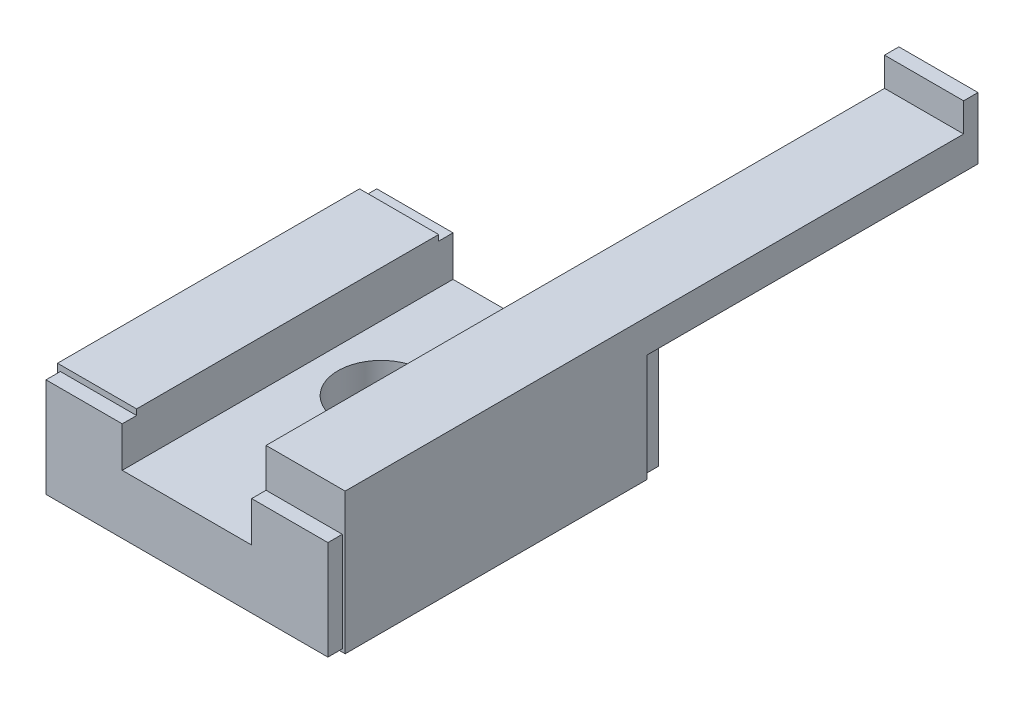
ISO-10303-21;
HEADER;
FILE_DESCRIPTION(('STEP AP214'),'2;1');
FILE_NAME('part.step','',(''),(''),'','','');
FILE_SCHEMA(('AUTOMOTIVE_DESIGN { 1 0 10303 214 1 1 1 1 }'));
ENDSEC;
DATA;
#1=APPLICATION_CONTEXT('core data for automotive mechanical design processes');
#2=APPLICATION_PROTOCOL_DEFINITION('international standard','automotive_design',2000,#1);
#3=PRODUCT_CONTEXT('',#1,'mechanical');
#4=PRODUCT('Part','Part','',(#3));
#5=PRODUCT_RELATED_PRODUCT_CATEGORY('part','',(#4));
#6=PRODUCT_DEFINITION_FORMATION('','',#4);
#7=PRODUCT_DEFINITION_CONTEXT('part definition',#1,'design');
#8=PRODUCT_DEFINITION('design','',#6,#7);
#9=PRODUCT_DEFINITION_SHAPE('','',#8);
#10=(LENGTH_UNIT() NAMED_UNIT(*) SI_UNIT(.MILLI.,.METRE.));
#11=(NAMED_UNIT(*) PLANE_ANGLE_UNIT() SI_UNIT($,.RADIAN.));
#12=(NAMED_UNIT(*) SI_UNIT($,.STERADIAN.) SOLID_ANGLE_UNIT());
#13=UNCERTAINTY_MEASURE_WITH_UNIT(LENGTH_MEASURE(1.E-05),#10,'distance_accuracy_value','');
#14=(GEOMETRIC_REPRESENTATION_CONTEXT(3) GLOBAL_UNCERTAINTY_ASSIGNED_CONTEXT((#13)) GLOBAL_UNIT_ASSIGNED_CONTEXT((#10,
#11,#12)) REPRESENTATION_CONTEXT('',''));
#15=CARTESIAN_POINT('',(0.,0.,0.));
#16=DIRECTION('',(0.,0.,1.));
#17=DIRECTION('',(1.,0.,0.));
#18=AXIS2_PLACEMENT_3D('',#15,#16,#17);
#19=CARTESIAN_POINT('',(4.5,9.8,22.));
#20=DIRECTION('',(0.,1.,0.));
#21=DIRECTION('',(1.,0.,0.));
#22=AXIS2_PLACEMENT_3D('',#19,#20,#21);
#23=PLANE('',#22);
#24=DIRECTION('',(-1.,0.,0.));
#25=VECTOR('',#24,1.);
#26=CARTESIAN_POINT('',(10.,9.8,-21.));
#27=LINE('',#26,#25);
#28=CARTESIAN_POINT('',(4.5,9.8,-21.));
#29=VERTEX_POINT('',#28);
#30=CARTESIAN_POINT('',(10.,9.8,-21.));
#31=VERTEX_POINT('',#30);
#32=EDGE_CURVE('E197',#29,#31,#27,.F.);
#33=ORIENTED_EDGE('',*,*,#32,.F.);
#34=DIRECTION('',(0.,0.,1.));
#35=VECTOR('',#34,1.);
#36=CARTESIAN_POINT('',(4.5,9.8,-21.));
#37=LINE('',#36,#35);
#38=CARTESIAN_POINT('',(4.5,9.8,22.));
#39=VERTEX_POINT('',#38);
#40=EDGE_CURVE('E212',#39,#29,#37,.F.);
#41=ORIENTED_EDGE('',*,*,#40,.F.);
#42=DIRECTION('',(1.,0.,0.));
#43=VECTOR('',#42,1.);
#44=CARTESIAN_POINT('',(4.5,9.8,22.));
#45=LINE('',#44,#43);
#46=CARTESIAN_POINT('',(10.,9.8,22.));
#47=VERTEX_POINT('',#46);
#48=EDGE_CURVE('E221',#47,#39,#45,.F.);
#49=ORIENTED_EDGE('',*,*,#48,.F.);
#50=DIRECTION('',(0.,0.,-1.));
#51=VECTOR('',#50,1.);
#52=CARTESIAN_POINT('',(10.,9.8,22.));
#53=LINE('',#52,#51);
#54=EDGE_CURVE('E214',#47,#31,#53,.T.);
#55=ORIENTED_EDGE('',*,*,#54,.T.);
#56=EDGE_LOOP('',(#33,#41,#49,#55));
#57=FACE_BOUND('',#56,.T.);
#58=ADVANCED_FACE('F16',(#57),#23,.T.);
#59=CARTESIAN_POINT('',(-10.,7.5,22.));
#60=DIRECTION('',(0.,1.,0.));
#61=DIRECTION('',(1.,0.,0.));
#62=AXIS2_PLACEMENT_3D('',#59,#60,#61);
#63=PLANE('',#62);
#64=DIRECTION('',(1.,0.,0.));
#65=VECTOR('',#64,1.);
#66=CARTESIAN_POINT('',(-10.,7.5,22.));
#67=LINE('',#66,#65);
#68=CARTESIAN_POINT('',(-4.5,7.5,22.));
#69=VERTEX_POINT('',#68);
#70=CARTESIAN_POINT('',(-10.,7.5,22.));
#71=VERTEX_POINT('',#70);
#72=EDGE_CURVE('E232',#69,#71,#67,.F.);
#73=ORIENTED_EDGE('',*,*,#72,.F.);
#74=DIRECTION('',(0.,0.,-1.));
#75=VECTOR('',#74,1.);
#76=CARTESIAN_POINT('',(-4.5,7.5,22.));
#77=LINE('',#76,#75);
#78=CARTESIAN_POINT('',(-4.5,7.5,1.));
#79=VERTEX_POINT('',#78);
#80=EDGE_CURVE('E236',#69,#79,#77,.T.);
#81=ORIENTED_EDGE('',*,*,#80,.T.);
#82=DIRECTION('',(-1.,0.,0.));
#83=VECTOR('',#82,1.);
#84=CARTESIAN_POINT('',(-4.5,7.5,1.));
#85=LINE('',#84,#83);
#86=CARTESIAN_POINT('',(-10.,7.5,1.));
#87=VERTEX_POINT('',#86);
#88=EDGE_CURVE('E241',#79,#87,#85,.T.);
#89=ORIENTED_EDGE('',*,*,#88,.T.);
#90=DIRECTION('',(0.,0.,1.));
#91=VECTOR('',#90,1.);
#92=CARTESIAN_POINT('',(-10.,7.5,1.));
#93=LINE('',#92,#91);
#94=EDGE_CURVE('E246',#71,#87,#93,.F.);
#95=ORIENTED_EDGE('',*,*,#94,.F.);
#96=EDGE_LOOP('',(#73,#81,#89,#95));
#97=FACE_BOUND('',#96,.T.);
#98=ADVANCED_FACE('F639',(#97),#63,.T.);
#99=CARTESIAN_POINT('',(-10.,0.,22.));
#100=DIRECTION('',(-1.,0.,0.));
#101=DIRECTION('',(0.,1.,0.));
#102=AXIS2_PLACEMENT_3D('',#99,#100,#101);
#103=PLANE('',#102);
#104=DIRECTION('',(0.,1.,0.));
#105=VECTOR('',#104,1.);
#106=CARTESIAN_POINT('',(-10.,0.,22.));
#107=LINE('',#106,#105);
#108=CARTESIAN_POINT('',(-10.,0.,22.));
#109=VERTEX_POINT('',#108);
#110=EDGE_CURVE('E251',#71,#109,#107,.F.);
#111=ORIENTED_EDGE('',*,*,#110,.F.);
#112=ORIENTED_EDGE('',*,*,#94,.T.);
#113=DIRECTION('',(0.,-1.,0.));
#114=VECTOR('',#113,1.);
#115=CARTESIAN_POINT('',(-10.,7.5,1.));
#116=LINE('',#115,#114);
#117=CARTESIAN_POINT('',(-10.,0.,1.));
#118=VERTEX_POINT('',#117);
#119=EDGE_CURVE('E255',#87,#118,#116,.T.);
#120=ORIENTED_EDGE('',*,*,#119,.T.);
#121=DIRECTION('',(0.,0.,1.));
#122=VECTOR('',#121,1.);
#123=CARTESIAN_POINT('',(-10.,0.,1.));
#124=LINE('',#123,#122);
#125=EDGE_CURVE('E260',#109,#118,#124,.F.);
#126=ORIENTED_EDGE('',*,*,#125,.F.);
#127=EDGE_LOOP('',(#111,#112,#120,#126));
#128=FACE_BOUND('',#127,.T.);
#129=ADVANCED_FACE('F644',(#128),#103,.T.);
#130=CARTESIAN_POINT('',(-10.,0.,1.));
#131=DIRECTION('',(0.,-1.,0.));
#132=DIRECTION('',(1.,0.,0.));
#133=AXIS2_PLACEMENT_3D('',#130,#131,#132);
#134=PLANE('',#133);
#135=DIRECTION('',(-1.,0.,0.));
#136=VECTOR('',#135,1.);
#137=CARTESIAN_POINT('',(-4.,0.,22.));
#138=LINE('',#137,#136);
#139=CARTESIAN_POINT('',(-4.,0.,22.));
#140=VERTEX_POINT('',#139);
#141=EDGE_CURVE('E265',#109,#140,#138,.F.);
#142=ORIENTED_EDGE('',*,*,#141,.F.);
#143=ORIENTED_EDGE('',*,*,#125,.T.);
#144=DIRECTION('',(1.,0.,0.));
#145=VECTOR('',#144,1.);
#146=CARTESIAN_POINT('',(-10.,0.,1.));
#147=LINE('',#146,#145);
#148=CARTESIAN_POINT('',(-4.,0.,1.));
#149=VERTEX_POINT('',#148);
#150=EDGE_CURVE('E269',#118,#149,#147,.T.);
#151=ORIENTED_EDGE('',*,*,#150,.T.);
#152=DIRECTION('',(0.,0.,1.));
#153=VECTOR('',#152,1.);
#154=CARTESIAN_POINT('',(-4.,0.,1.));
#155=LINE('',#154,#153);
#156=EDGE_CURVE('E274',#140,#149,#155,.F.);
#157=ORIENTED_EDGE('',*,*,#156,.F.);
#158=EDGE_LOOP('',(#142,#143,#151,#157));
#159=FACE_BOUND('',#158,.T.);
#160=CARTESIAN_POINT('',(-7.5,0.,5.5));
#161=DIRECTION('',(0.,1.,0.));
#162=DIRECTION('',(0.,0.,-1.));
#163=AXIS2_PLACEMENT_3D('',#160,#161,#162);
#164=CIRCLE('',#163,1.5);
#165=CARTESIAN_POINT('',(-7.5,0.,4.));
#166=VERTEX_POINT('',#165);
#167=EDGE_CURVE('E279',#166,#166,#164,.F.);
#168=ORIENTED_EDGE('',*,*,#167,.F.);
#169=EDGE_LOOP('',(#168));
#170=FACE_BOUND('',#169,.T.);
#171=CARTESIAN_POINT('',(-7.5,0.,17.5));
#172=DIRECTION('',(0.,1.,0.));
#173=DIRECTION('',(0.,0.,-1.));
#174=AXIS2_PLACEMENT_3D('',#171,#172,#173);
#175=CIRCLE('',#174,1.5);
#176=CARTESIAN_POINT('',(-7.5,0.,16.));
#177=VERTEX_POINT('',#176);
#178=EDGE_CURVE('E284',#177,#177,#175,.F.);
#179=ORIENTED_EDGE('',*,*,#178,.F.);
#180=EDGE_LOOP('',(#179));
#181=FACE_BOUND('',#180,.T.);
#182=ADVANCED_FACE('F650',(#159,#170,#181),#134,.T.);
#183=CARTESIAN_POINT('',(-3.8,0.2,1.));
#184=DIRECTION('',(0.707106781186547,-0.707106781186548,0.));
#185=DIRECTION('',(0.,0.,1.));
#186=AXIS2_PLACEMENT_3D('',#183,#184,#185);
#187=PLANE('',#186);
#188=DIRECTION('',(-0.707106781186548,-0.707106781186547,0.));
#189=VECTOR('',#188,1.);
#190=CARTESIAN_POINT('',(-3.8,0.2,22.));
#191=LINE('',#190,#189);
#192=CARTESIAN_POINT('',(-3.8,0.2,22.));
#193=VERTEX_POINT('',#192);
#194=EDGE_CURVE('E287',#140,#193,#191,.F.);
#195=ORIENTED_EDGE('',*,*,#194,.F.);
#196=ORIENTED_EDGE('',*,*,#156,.T.);
#197=DIRECTION('',(0.707106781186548,0.707106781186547,0.));
#198=VECTOR('',#197,1.);
#199=CARTESIAN_POINT('',(-4.,0.,1.));
#200=LINE('',#199,#198);
#201=CARTESIAN_POINT('',(-3.8,0.199999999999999,1.));
#202=VERTEX_POINT('',#201);
#203=EDGE_CURVE('E289',#149,#202,#200,.T.);
#204=ORIENTED_EDGE('',*,*,#203,.T.);
#205=DIRECTION('',(0.,0.,1.));
#206=VECTOR('',#205,1.);
#207=CARTESIAN_POINT('',(-3.8,0.199999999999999,1.));
#208=LINE('',#207,#206);
#209=EDGE_CURVE('E294',#193,#202,#208,.F.);
#210=ORIENTED_EDGE('',*,*,#209,.F.);
#211=EDGE_LOOP('',(#195,#196,#204,#210));
#212=FACE_BOUND('',#211,.T.);
#213=ADVANCED_FACE('F654',(#212),#187,.T.);
#214=CARTESIAN_POINT('',(4.,0.,1.));
#215=DIRECTION('',(-0.707106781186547,-0.707106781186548,0.));
#216=DIRECTION('',(0.,0.,1.));
#217=AXIS2_PLACEMENT_3D('',#214,#215,#216);
#218=PLANE('',#217);
#219=DIRECTION('',(-0.707106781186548,0.707106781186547,0.));
#220=VECTOR('',#219,1.);
#221=CARTESIAN_POINT('',(4.,0.,22.));
#222=LINE('',#221,#220);
#223=CARTESIAN_POINT('',(3.8,0.2,22.));
#224=VERTEX_POINT('',#223);
#225=CARTESIAN_POINT('',(4.,0.,22.));
#226=VERTEX_POINT('',#225);
#227=EDGE_CURVE('E299',#224,#226,#222,.F.);
#228=ORIENTED_EDGE('',*,*,#227,.F.);
#229=DIRECTION('',(0.,0.,-1.));
#230=VECTOR('',#229,1.);
#231=CARTESIAN_POINT('',(3.8,0.2,22.));
#232=LINE('',#231,#230);
#233=CARTESIAN_POINT('',(3.8,0.2,1.));
#234=VERTEX_POINT('',#233);
#235=EDGE_CURVE('E303',#224,#234,#232,.T.);
#236=ORIENTED_EDGE('',*,*,#235,.T.);
#237=DIRECTION('',(0.707106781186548,-0.707106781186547,0.));
#238=VECTOR('',#237,1.);
#239=CARTESIAN_POINT('',(3.8,0.2,1.));
#240=LINE('',#239,#238);
#241=CARTESIAN_POINT('',(4.,0.,1.));
#242=VERTEX_POINT('',#241);
#243=EDGE_CURVE('E308',#234,#242,#240,.T.);
#244=ORIENTED_EDGE('',*,*,#243,.T.);
#245=DIRECTION('',(0.,0.,1.));
#246=VECTOR('',#245,1.);
#247=CARTESIAN_POINT('',(4.,0.,1.));
#248=LINE('',#247,#246);
#249=EDGE_CURVE('E313',#226,#242,#248,.F.);
#250=ORIENTED_EDGE('',*,*,#249,.F.);
#251=EDGE_LOOP('',(#228,#236,#244,#250));
#252=FACE_BOUND('',#251,.T.);
#253=ADVANCED_FACE('F658',(#252),#218,.T.);
#254=CARTESIAN_POINT('',(4.,0.,1.));
#255=DIRECTION('',(0.,-1.,0.));
#256=DIRECTION('',(1.,0.,0.));
#257=AXIS2_PLACEMENT_3D('',#254,#255,#256);
#258=PLANE('',#257);
#259=DIRECTION('',(-1.,0.,0.));
#260=VECTOR('',#259,1.);
#261=CARTESIAN_POINT('',(10.,0.,22.));
#262=LINE('',#261,#260);
#263=CARTESIAN_POINT('',(10.,0.,22.));
#264=VERTEX_POINT('',#263);
#265=EDGE_CURVE('E318',#226,#264,#262,.F.);
#266=ORIENTED_EDGE('',*,*,#265,.F.);
#267=ORIENTED_EDGE('',*,*,#249,.T.);
#268=DIRECTION('',(1.,0.,0.));
#269=VECTOR('',#268,1.);
#270=CARTESIAN_POINT('',(4.,0.,1.));
#271=LINE('',#270,#269);
#272=CARTESIAN_POINT('',(10.,0.,1.));
#273=VERTEX_POINT('',#272);
#274=EDGE_CURVE('E322',#242,#273,#271,.T.);
#275=ORIENTED_EDGE('',*,*,#274,.T.);
#276=DIRECTION('',(0.,0.,1.));
#277=VECTOR('',#276,1.);
#278=CARTESIAN_POINT('',(10.,0.,1.));
#279=LINE('',#278,#277);
#280=EDGE_CURVE('E327',#264,#273,#279,.F.);
#281=ORIENTED_EDGE('',*,*,#280,.F.);
#282=EDGE_LOOP('',(#266,#267,#275,#281));
#283=FACE_BOUND('',#282,.T.);
#284=CARTESIAN_POINT('',(7.5,0.,5.5));
#285=DIRECTION('',(0.,1.,0.));
#286=DIRECTION('',(0.,0.,-1.));
#287=AXIS2_PLACEMENT_3D('',#284,#285,#286);
#288=CIRCLE('',#287,1.5);
#289=CARTESIAN_POINT('',(7.5,0.,4.));
#290=VERTEX_POINT('',#289);
#291=EDGE_CURVE('E332',#290,#290,#288,.F.);
#292=ORIENTED_EDGE('',*,*,#291,.F.);
#293=EDGE_LOOP('',(#292));
#294=FACE_BOUND('',#293,.T.);
#295=CARTESIAN_POINT('',(7.5,0.,17.5));
#296=DIRECTION('',(0.,1.,0.));
#297=DIRECTION('',(0.,0.,-1.));
#298=AXIS2_PLACEMENT_3D('',#295,#296,#297);
#299=CIRCLE('',#298,1.5);
#300=CARTESIAN_POINT('',(7.5,0.,16.));
#301=VERTEX_POINT('',#300);
#302=EDGE_CURVE('E337',#301,#301,#299,.F.);
#303=ORIENTED_EDGE('',*,*,#302,.F.);
#304=EDGE_LOOP('',(#303));
#305=FACE_BOUND('',#304,.T.);
#306=ADVANCED_FACE('F662',(#283,#294,#305),#258,.T.);
#307=CARTESIAN_POINT('',(10.,0.,-22.));
#308=DIRECTION('',(1.,0.,0.));
#309=DIRECTION('',(0.,1.,0.));
#310=AXIS2_PLACEMENT_3D('',#307,#308,#309);
#311=PLANE('',#310);
#312=DIRECTION('',(0.,-1.,0.));
#313=VECTOR('',#312,1.);
#314=CARTESIAN_POINT('',(10.,9.8,22.));
#315=LINE('',#314,#313);
#316=EDGE_CURVE('E340',#264,#47,#315,.F.);
#317=ORIENTED_EDGE('',*,*,#316,.F.);
#318=ORIENTED_EDGE('',*,*,#280,.T.);
#319=DIRECTION('',(0.,1.,0.));
#320=VECTOR('',#319,1.);
#321=CARTESIAN_POINT('',(10.,0.,0.999999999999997));
#322=LINE('',#321,#320);
#323=CARTESIAN_POINT('',(10.,7.5,0.999999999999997));
#324=VERTEX_POINT('',#323);
#325=EDGE_CURVE('E342',#273,#324,#322,.T.);
#326=ORIENTED_EDGE('',*,*,#325,.T.);
#327=DIRECTION('',(0.,0.,-1.));
#328=VECTOR('',#327,1.);
#329=CARTESIAN_POINT('',(10.,7.5,0.999999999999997));
#330=LINE('',#329,#328);
#331=CARTESIAN_POINT('',(10.,7.5,-22.));
#332=VERTEX_POINT('',#331);
#333=EDGE_CURVE('E347',#332,#324,#330,.F.);
#334=ORIENTED_EDGE('',*,*,#333,.F.);
#335=DIRECTION('',(0.,1.,0.));
#336=VECTOR('',#335,1.);
#337=CARTESIAN_POINT('',(10.,7.5,-22.));
#338=LINE('',#337,#336);
#339=CARTESIAN_POINT('',(10.,11.8,-22.));
#340=VERTEX_POINT('',#339);
#341=EDGE_CURVE('E351',#332,#340,#338,.T.);
#342=ORIENTED_EDGE('',*,*,#341,.T.);
#343=DIRECTION('',(0.,0.,1.));
#344=VECTOR('',#343,1.);
#345=CARTESIAN_POINT('',(10.,11.8,-22.));
#346=LINE('',#345,#344);
#347=CARTESIAN_POINT('',(10.,11.8,-21.));
#348=VERTEX_POINT('',#347);
#349=EDGE_CURVE('E356',#348,#340,#346,.F.);
#350=ORIENTED_EDGE('',*,*,#349,.F.);
#351=DIRECTION('',(0.,-1.,0.));
#352=VECTOR('',#351,1.);
#353=CARTESIAN_POINT('',(10.,11.8,-21.));
#354=LINE('',#353,#352);
#355=EDGE_CURVE('E360',#31,#348,#354,.F.);
#356=ORIENTED_EDGE('',*,*,#355,.F.);
#357=ORIENTED_EDGE('',*,*,#54,.F.);
#358=EDGE_LOOP('',(#317,#318,#326,#334,#342,#350,#356,#357));
#359=FACE_BOUND('',#358,.T.);
#360=ADVANCED_FACE('F666',(#359),#311,.T.);
#361=CARTESIAN_POINT('',(4.5,4.3,23.));
#362=DIRECTION('',(-1.,0.,0.));
#363=DIRECTION('',(0.,1.,0.));
#364=AXIS2_PLACEMENT_3D('',#361,#362,#363);
#365=PLANE('',#364);
#366=DIRECTION('',(0.,1.,0.));
#367=VECTOR('',#366,1.);
#368=CARTESIAN_POINT('',(4.5,4.3,23.));
#369=LINE('',#368,#367);
#370=CARTESIAN_POINT('',(4.5,7.1,23.));
#371=VERTEX_POINT('',#370);
#372=CARTESIAN_POINT('',(4.5,4.3,23.));
#373=VERTEX_POINT('',#372);
#374=EDGE_CURVE('E364',#371,#373,#369,.F.);
#375=ORIENTED_EDGE('',*,*,#374,.F.);
#376=DIRECTION('',(0.,0.,-1.));
#377=VECTOR('',#376,1.);
#378=CARTESIAN_POINT('',(4.5,7.1,23.));
#379=LINE('',#378,#377);
#380=CARTESIAN_POINT('',(4.5,7.1,22.));
#381=VERTEX_POINT('',#380);
#382=EDGE_CURVE('E368',#381,#371,#379,.F.);
#383=ORIENTED_EDGE('',*,*,#382,.F.);
#384=DIRECTION('',(0.,1.,0.));
#385=VECTOR('',#384,1.);
#386=CARTESIAN_POINT('',(4.5,7.1,22.));
#387=LINE('',#386,#385);
#388=EDGE_CURVE('E206',#39,#381,#387,.F.);
#389=ORIENTED_EDGE('',*,*,#388,.F.);
#390=ORIENTED_EDGE('',*,*,#40,.T.);
#391=DIRECTION('',(0.,1.,0.));
#392=VECTOR('',#391,1.);
#393=CARTESIAN_POINT('',(4.5,9.8,-21.));
#394=LINE('',#393,#392);
#395=CARTESIAN_POINT('',(4.5,11.8,-21.));
#396=VERTEX_POINT('',#395);
#397=EDGE_CURVE('E194',#396,#29,#394,.F.);
#398=ORIENTED_EDGE('',*,*,#397,.F.);
#399=DIRECTION('',(0.,0.,-1.));
#400=VECTOR('',#399,1.);
#401=CARTESIAN_POINT('',(4.5,11.8,-21.));
#402=LINE('',#401,#400);
#403=CARTESIAN_POINT('',(4.5,11.8,-22.));
#404=VERTEX_POINT('',#403);
#405=EDGE_CURVE('E205',#396,#404,#402,.T.);
#406=ORIENTED_EDGE('',*,*,#405,.T.);
#407=DIRECTION('',(0.,-1.,0.));
#408=VECTOR('',#407,1.);
#409=CARTESIAN_POINT('',(4.5,11.8,-22.));
#410=LINE('',#409,#408);
#411=CARTESIAN_POINT('',(4.5,7.5,-22.));
#412=VERTEX_POINT('',#411);
#413=EDGE_CURVE('E380',#404,#412,#410,.T.);
#414=ORIENTED_EDGE('',*,*,#413,.T.);
#415=DIRECTION('',(0.,0.,1.));
#416=VECTOR('',#415,1.);
#417=CARTESIAN_POINT('',(4.5,7.5,-22.));
#418=LINE('',#417,#416);
#419=CARTESIAN_POINT('',(4.5,7.5,0.));
#420=VERTEX_POINT('',#419);
#421=EDGE_CURVE('E385',#412,#420,#418,.T.);
#422=ORIENTED_EDGE('',*,*,#421,.T.);
#423=DIRECTION('',(0.,-1.,0.));
#424=VECTOR('',#423,1.);
#425=CARTESIAN_POINT('',(4.5,7.5,0.));
#426=LINE('',#425,#424);
#427=CARTESIAN_POINT('',(4.5,4.3,0.));
#428=VERTEX_POINT('',#427);
#429=EDGE_CURVE('E390',#420,#428,#426,.T.);
#430=ORIENTED_EDGE('',*,*,#429,.T.);
#431=DIRECTION('',(0.,0.,1.));
#432=VECTOR('',#431,1.);
#433=CARTESIAN_POINT('',(4.5,4.3,0.));
#434=LINE('',#433,#432);
#435=EDGE_CURVE('E395',#373,#428,#434,.F.);
#436=ORIENTED_EDGE('',*,*,#435,.F.);
#437=EDGE_LOOP('',(#375,#383,#389,#390,#398,#406,#414,#422,#430,#436));
#438=FACE_BOUND('',#437,.T.);
#439=ADVANCED_FACE('F218',(#438),#365,.T.);
#440=CARTESIAN_POINT('',(-4.5,4.3,0.));
#441=DIRECTION('',(1.,0.,0.));
#442=DIRECTION('',(0.,1.,0.));
#443=AXIS2_PLACEMENT_3D('',#440,#441,#442);
#444=PLANE('',#443);
#445=DIRECTION('',(0.,-1.,0.));
#446=VECTOR('',#445,1.);
#447=CARTESIAN_POINT('',(-4.5,7.5,22.));
#448=LINE('',#447,#446);
#449=CARTESIAN_POINT('',(-4.5,7.1,22.));
#450=VERTEX_POINT('',#449);
#451=EDGE_CURVE('E399',#450,#69,#448,.F.);
#452=ORIENTED_EDGE('',*,*,#451,.F.);
#453=DIRECTION('',(0.,0.,1.));
#454=VECTOR('',#453,1.);
#455=CARTESIAN_POINT('',(-4.5,7.1,22.));
#456=LINE('',#455,#454);
#457=CARTESIAN_POINT('',(-4.5,7.1,23.));
#458=VERTEX_POINT('',#457);
#459=EDGE_CURVE('E403',#450,#458,#456,.T.);
#460=ORIENTED_EDGE('',*,*,#459,.T.);
#461=DIRECTION('',(0.,-1.,0.));
#462=VECTOR('',#461,1.);
#463=CARTESIAN_POINT('',(-4.5,7.1,23.));
#464=LINE('',#463,#462);
#465=CARTESIAN_POINT('',(-4.5,4.3,23.));
#466=VERTEX_POINT('',#465);
#467=EDGE_CURVE('E408',#466,#458,#464,.F.);
#468=ORIENTED_EDGE('',*,*,#467,.F.);
#469=DIRECTION('',(0.,0.,-1.));
#470=VECTOR('',#469,1.);
#471=CARTESIAN_POINT('',(-4.5,4.3,23.));
#472=LINE('',#471,#470);
#473=CARTESIAN_POINT('',(-4.5,4.3,0.));
#474=VERTEX_POINT('',#473);
#475=EDGE_CURVE('E413',#466,#474,#472,.T.);
#476=ORIENTED_EDGE('',*,*,#475,.T.);
#477=DIRECTION('',(0.,1.,0.));
#478=VECTOR('',#477,1.);
#479=CARTESIAN_POINT('',(-4.5,4.3,0.));
#480=LINE('',#479,#478);
#481=CARTESIAN_POINT('',(-4.5,7.1,0.));
#482=VERTEX_POINT('',#481);
#483=EDGE_CURVE('E418',#474,#482,#480,.T.);
#484=ORIENTED_EDGE('',*,*,#483,.T.);
#485=DIRECTION('',(0.,0.,1.));
#486=VECTOR('',#485,1.);
#487=CARTESIAN_POINT('',(-4.5,7.1,0.));
#488=LINE('',#487,#486);
#489=CARTESIAN_POINT('',(-4.5,7.1,1.));
#490=VERTEX_POINT('',#489);
#491=EDGE_CURVE('E423',#490,#482,#488,.F.);
#492=ORIENTED_EDGE('',*,*,#491,.F.);
#493=DIRECTION('',(0.,1.,0.));
#494=VECTOR('',#493,1.);
#495=CARTESIAN_POINT('',(-4.5,7.1,1.));
#496=LINE('',#495,#494);
#497=EDGE_CURVE('E427',#490,#79,#496,.T.);
#498=ORIENTED_EDGE('',*,*,#497,.T.);
#499=ORIENTED_EDGE('',*,*,#80,.F.);
#500=EDGE_LOOP('',(#452,#460,#468,#476,#484,#492,#498,#499));
#501=FACE_BOUND('',#500,.T.);
#502=ADVANCED_FACE('F673',(#501),#444,.T.);
#503=CARTESIAN_POINT('',(-9.8,0.2,0.));
#504=DIRECTION('',(0.,0.,-1.));
#505=DIRECTION('',(0.,1.,0.));
#506=AXIS2_PLACEMENT_3D('',#503,#504,#505);
#507=PLANE('',#506);
#508=DIRECTION('',(1.,0.,0.));
#509=VECTOR('',#508,1.);
#510=CARTESIAN_POINT('',(4.5,7.5,0.));
#511=LINE('',#510,#509);
#512=CARTESIAN_POINT('',(9.8,7.5,0.));
#513=VERTEX_POINT('',#512);
#514=EDGE_CURVE('E432',#420,#513,#511,.T.);
#515=ORIENTED_EDGE('',*,*,#514,.T.);
#516=DIRECTION('',(0.,-1.,0.));
#517=VECTOR('',#516,1.);
#518=CARTESIAN_POINT('',(9.8,7.5,0.));
#519=LINE('',#518,#517);
#520=CARTESIAN_POINT('',(9.8,0.2,0.));
#521=VERTEX_POINT('',#520);
#522=EDGE_CURVE('E437',#513,#521,#519,.T.);
#523=ORIENTED_EDGE('',*,*,#522,.T.);
#524=DIRECTION('',(-1.,0.,0.));
#525=VECTOR('',#524,1.);
#526=CARTESIAN_POINT('',(9.79999999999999,0.2,0.));
#527=LINE('',#526,#525);
#528=CARTESIAN_POINT('',(-9.8,0.2,0.));
#529=VERTEX_POINT('',#528);
#530=EDGE_CURVE('E442',#529,#521,#527,.F.);
#531=ORIENTED_EDGE('',*,*,#530,.F.);
#532=DIRECTION('',(0.,1.,0.));
#533=VECTOR('',#532,1.);
#534=CARTESIAN_POINT('',(-9.8,0.2,0.));
#535=LINE('',#534,#533);
#536=CARTESIAN_POINT('',(-9.8,7.1,0.));
#537=VERTEX_POINT('',#536);
#538=EDGE_CURVE('E447',#529,#537,#535,.T.);
#539=ORIENTED_EDGE('',*,*,#538,.T.);
#540=DIRECTION('',(1.,0.,0.));
#541=VECTOR('',#540,1.);
#542=CARTESIAN_POINT('',(-9.8,7.1,0.));
#543=LINE('',#542,#541);
#544=EDGE_CURVE('E452',#537,#482,#543,.T.);
#545=ORIENTED_EDGE('',*,*,#544,.T.);
#546=ORIENTED_EDGE('',*,*,#483,.F.);
#547=DIRECTION('',(1.,0.,0.));
#548=VECTOR('',#547,1.);
#549=CARTESIAN_POINT('',(-4.5,4.3,0.));
#550=LINE('',#549,#548);
#551=EDGE_CURVE('E457',#428,#474,#550,.F.);
#552=ORIENTED_EDGE('',*,*,#551,.F.);
#553=ORIENTED_EDGE('',*,*,#429,.F.);
#554=EDGE_LOOP('',(#515,#523,#531,#539,#545,#546,#552,#553));
#555=FACE_BOUND('',#554,.T.);
#556=ADVANCED_FACE('F676',(#555),#507,.T.);
#557=CARTESIAN_POINT('',(-9.8,0.2,0.));
#558=DIRECTION('',(0.,-1.,0.));
#559=DIRECTION('',(1.,0.,0.));
#560=AXIS2_PLACEMENT_3D('',#557,#558,#559);
#561=PLANE('',#560);
#562=DIRECTION('',(-1.,0.,0.));
#563=VECTOR('',#562,1.);
#564=CARTESIAN_POINT('',(9.8,0.2,23.));
#565=LINE('',#564,#563);
#566=CARTESIAN_POINT('',(-9.8,0.2,23.));
#567=VERTEX_POINT('',#566);
#568=CARTESIAN_POINT('',(9.8,0.2,23.));
#569=VERTEX_POINT('',#568);
#570=EDGE_CURVE('E461',#567,#569,#565,.F.);
#571=ORIENTED_EDGE('',*,*,#570,.F.);
#572=DIRECTION('',(0.,0.,-1.));
#573=VECTOR('',#572,1.);
#574=CARTESIAN_POINT('',(-9.8,0.2,23.));
#575=LINE('',#574,#573);
#576=CARTESIAN_POINT('',(-9.8,0.2,22.));
#577=VERTEX_POINT('',#576);
#578=EDGE_CURVE('E466',#577,#567,#575,.F.);
#579=ORIENTED_EDGE('',*,*,#578,.F.);
#580=DIRECTION('',(1.,0.,0.));
#581=VECTOR('',#580,1.);
#582=CARTESIAN_POINT('',(-9.8,0.2,22.));
#583=LINE('',#582,#581);
#584=EDGE_CURVE('E470',#193,#577,#583,.F.);
#585=ORIENTED_EDGE('',*,*,#584,.F.);
#586=ORIENTED_EDGE('',*,*,#209,.T.);
#587=DIRECTION('',(-1.,0.,0.));
#588=VECTOR('',#587,1.);
#589=CARTESIAN_POINT('',(-3.8,0.2,1.));
#590=LINE('',#589,#588);
#591=CARTESIAN_POINT('',(-9.8,0.2,1.));
#592=VERTEX_POINT('',#591);
#593=EDGE_CURVE('E474',#202,#592,#590,.T.);
#594=ORIENTED_EDGE('',*,*,#593,.T.);
#595=DIRECTION('',(0.,0.,-1.));
#596=VECTOR('',#595,1.);
#597=CARTESIAN_POINT('',(-9.8,0.2,1.));
#598=LINE('',#597,#596);
#599=EDGE_CURVE('E479',#592,#529,#598,.T.);
#600=ORIENTED_EDGE('',*,*,#599,.T.);
#601=ORIENTED_EDGE('',*,*,#530,.T.);
#602=DIRECTION('',(0.,0.,1.));
#603=VECTOR('',#602,1.);
#604=CARTESIAN_POINT('',(9.8,0.2,0.));
#605=LINE('',#604,#603);
#606=CARTESIAN_POINT('',(9.8,0.2,1.));
#607=VERTEX_POINT('',#606);
#608=EDGE_CURVE('E484',#607,#521,#605,.F.);
#609=ORIENTED_EDGE('',*,*,#608,.F.);
#610=DIRECTION('',(-1.,0.,0.));
#611=VECTOR('',#610,1.);
#612=CARTESIAN_POINT('',(9.8,0.2,1.));
#613=LINE('',#612,#611);
#614=EDGE_CURVE('E488',#607,#234,#613,.T.);
#615=ORIENTED_EDGE('',*,*,#614,.T.);
#616=ORIENTED_EDGE('',*,*,#235,.F.);
#617=DIRECTION('',(1.,0.,0.));
#618=VECTOR('',#617,1.);
#619=CARTESIAN_POINT('',(3.8,0.2,22.));
#620=LINE('',#619,#618);
#621=CARTESIAN_POINT('',(9.8,0.2,22.));
#622=VERTEX_POINT('',#621);
#623=EDGE_CURVE('E493',#622,#224,#620,.F.);
#624=ORIENTED_EDGE('',*,*,#623,.F.);
#625=DIRECTION('',(0.,0.,1.));
#626=VECTOR('',#625,1.);
#627=CARTESIAN_POINT('',(9.8,0.2,22.));
#628=LINE('',#627,#626);
#629=EDGE_CURVE('E497',#622,#569,#628,.T.);
#630=ORIENTED_EDGE('',*,*,#629,.T.);
#631=EDGE_LOOP('',(#571,#579,#585,#586,#594,#600,#601,#609,#615,#616,#624,#630));
#632=FACE_BOUND('',#631,.T.);
#633=CARTESIAN_POINT('',(0.,0.2,9.5));
#634=DIRECTION('',(0.,1.,0.));
#635=DIRECTION('',(0.,0.,-1.));
#636=AXIS2_PLACEMENT_3D('',#633,#634,#635);
#637=CIRCLE('',#636,3.);
#638=CARTESIAN_POINT('',(0.,0.2,6.5));
#639=VERTEX_POINT('',#638);
#640=EDGE_CURVE('E502',#639,#639,#637,.F.);
#641=ORIENTED_EDGE('',*,*,#640,.F.);
#642=EDGE_LOOP('',(#641));
#643=FACE_BOUND('',#642,.T.);
#644=CARTESIAN_POINT('',(0.,0.2,17.5));
#645=DIRECTION('',(0.,1.,0.));
#646=DIRECTION('',(-1.42054093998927E-07,0.,-0.99999999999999));
#647=AXIS2_PLACEMENT_3D('',#644,#645,#646);
#648=CIRCLE('',#647,1.25);
#649=CARTESIAN_POINT('',(-1.77567617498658E-07,0.2,16.25));
#650=VERTEX_POINT('',#649);
#651=EDGE_CURVE('E507',#650,#650,#648,.F.);
#652=ORIENTED_EDGE('',*,*,#651,.F.);
#653=EDGE_LOOP('',(#652));
#654=FACE_BOUND('',#653,.T.);
#655=ADVANCED_FACE('F680',(#632,#643,#654),#561,.T.);
#656=CARTESIAN_POINT('',(-4.5,4.3,23.));
#657=DIRECTION('',(0.,1.,0.));
#658=DIRECTION('',(1.,0.,0.));
#659=AXIS2_PLACEMENT_3D('',#656,#657,#658);
#660=PLANE('',#659);
#661=ORIENTED_EDGE('',*,*,#551,.T.);
#662=ORIENTED_EDGE('',*,*,#475,.F.);
#663=DIRECTION('',(1.,0.,0.));
#664=VECTOR('',#663,1.);
#665=CARTESIAN_POINT('',(-4.5,4.3,23.));
#666=LINE('',#665,#664);
#667=EDGE_CURVE('E510',#373,#466,#666,.F.);
#668=ORIENTED_EDGE('',*,*,#667,.F.);
#669=ORIENTED_EDGE('',*,*,#435,.T.);
#670=EDGE_LOOP('',(#661,#662,#668,#669));
#671=FACE_BOUND('',#670,.T.);
#672=CARTESIAN_POINT('',(0.,4.3,9.5));
#673=DIRECTION('',(0.,-1.,0.));
#674=DIRECTION('',(0.,0.,1.));
#675=AXIS2_PLACEMENT_3D('',#672,#673,#674);
#676=CIRCLE('',#675,3.);
#677=CARTESIAN_POINT('',(0.,4.3,12.5));
#678=VERTEX_POINT('',#677);
#679=EDGE_CURVE('E512',#678,#678,#676,.F.);
#680=ORIENTED_EDGE('',*,*,#679,.F.);
#681=EDGE_LOOP('',(#680));
#682=FACE_BOUND('',#681,.T.);
#683=ADVANCED_FACE('F684',(#671,#682),#660,.T.);
#684=CARTESIAN_POINT('',(-9.8,0.2,23.));
#685=DIRECTION('',(0.,0.,1.));
#686=DIRECTION('',(1.,0.,0.));
#687=AXIS2_PLACEMENT_3D('',#684,#685,#686);
#688=PLANE('',#687);
#689=DIRECTION('',(-1.,0.,0.));
#690=VECTOR('',#689,1.);
#691=CARTESIAN_POINT('',(9.8,7.1,23.));
#692=LINE('',#691,#690);
#693=CARTESIAN_POINT('',(9.8,7.1,23.));
#694=VERTEX_POINT('',#693);
#695=EDGE_CURVE('E517',#371,#694,#692,.F.);
#696=ORIENTED_EDGE('',*,*,#695,.F.);
#697=ORIENTED_EDGE('',*,*,#374,.T.);
#698=ORIENTED_EDGE('',*,*,#667,.T.);
#699=ORIENTED_EDGE('',*,*,#467,.T.);
#700=DIRECTION('',(-1.,0.,0.));
#701=VECTOR('',#700,1.);
#702=CARTESIAN_POINT('',(-4.5,7.1,23.));
#703=LINE('',#702,#701);
#704=CARTESIAN_POINT('',(-9.8,7.1,23.));
#705=VERTEX_POINT('',#704);
#706=EDGE_CURVE('E520',#705,#458,#703,.F.);
#707=ORIENTED_EDGE('',*,*,#706,.F.);
#708=DIRECTION('',(0.,-1.,0.));
#709=VECTOR('',#708,1.);
#710=CARTESIAN_POINT('',(-9.8,7.1,23.));
#711=LINE('',#710,#709);
#712=EDGE_CURVE('E524',#567,#705,#711,.F.);
#713=ORIENTED_EDGE('',*,*,#712,.F.);
#714=ORIENTED_EDGE('',*,*,#570,.T.);
#715=DIRECTION('',(0.,1.,0.));
#716=VECTOR('',#715,1.);
#717=CARTESIAN_POINT('',(9.8,0.2,23.));
#718=LINE('',#717,#716);
#719=EDGE_CURVE('E528',#694,#569,#718,.F.);
#720=ORIENTED_EDGE('',*,*,#719,.F.);
#721=EDGE_LOOP('',(#696,#697,#698,#699,#707,#713,#714,#720));
#722=FACE_BOUND('',#721,.T.);
#723=ADVANCED_FACE('F688',(#722),#688,.T.);
#724=CARTESIAN_POINT('',(-9.8,7.1,0.));
#725=DIRECTION('',(0.,1.,0.));
#726=DIRECTION('',(0.,0.,1.));
#727=AXIS2_PLACEMENT_3D('',#724,#725,#726);
#728=PLANE('',#727);
#729=ORIENTED_EDGE('',*,*,#544,.F.);
#730=DIRECTION('',(0.,0.,1.));
#731=VECTOR('',#730,1.);
#732=CARTESIAN_POINT('',(-9.8,7.1,0.));
#733=LINE('',#732,#731);
#734=CARTESIAN_POINT('',(-9.8,7.1,1.));
#735=VERTEX_POINT('',#734);
#736=EDGE_CURVE('E532',#735,#537,#733,.F.);
#737=ORIENTED_EDGE('',*,*,#736,.F.);
#738=DIRECTION('',(1.,0.,0.));
#739=VECTOR('',#738,1.);
#740=CARTESIAN_POINT('',(-9.8,7.1,1.));
#741=LINE('',#740,#739);
#742=EDGE_CURVE('E536',#735,#490,#741,.T.);
#743=ORIENTED_EDGE('',*,*,#742,.T.);
#744=ORIENTED_EDGE('',*,*,#491,.T.);
#745=EDGE_LOOP('',(#729,#737,#743,#744));
#746=FACE_BOUND('',#745,.T.);
#747=ADVANCED_FACE('F692',(#746),#728,.T.);
#748=CARTESIAN_POINT('',(-9.8,0.2,0.));
#749=DIRECTION('',(-1.,0.,0.));
#750=DIRECTION('',(0.,0.,1.));
#751=AXIS2_PLACEMENT_3D('',#748,#749,#750);
#752=PLANE('',#751);
#753=ORIENTED_EDGE('',*,*,#538,.F.);
#754=ORIENTED_EDGE('',*,*,#599,.F.);
#755=DIRECTION('',(0.,1.,0.));
#756=VECTOR('',#755,1.);
#757=CARTESIAN_POINT('',(-9.8,0.2,1.));
#758=LINE('',#757,#756);
#759=EDGE_CURVE('E541',#592,#735,#758,.T.);
#760=ORIENTED_EDGE('',*,*,#759,.T.);
#761=ORIENTED_EDGE('',*,*,#736,.T.);
#762=EDGE_LOOP('',(#753,#754,#760,#761));
#763=FACE_BOUND('',#762,.T.);
#764=ADVANCED_FACE('F696',(#763),#752,.T.);
#765=CARTESIAN_POINT('',(-10.,0.,1.));
#766=DIRECTION('',(0.,0.,-1.));
#767=DIRECTION('',(0.,1.,0.));
#768=AXIS2_PLACEMENT_3D('',#765,#766,#767);
#769=PLANE('',#768);
#770=ORIENTED_EDGE('',*,*,#150,.F.);
#771=ORIENTED_EDGE('',*,*,#119,.F.);
#772=ORIENTED_EDGE('',*,*,#88,.F.);
#773=ORIENTED_EDGE('',*,*,#497,.F.);
#774=ORIENTED_EDGE('',*,*,#742,.F.);
#775=ORIENTED_EDGE('',*,*,#759,.F.);
#776=ORIENTED_EDGE('',*,*,#593,.F.);
#777=ORIENTED_EDGE('',*,*,#203,.F.);
#778=EDGE_LOOP('',(#770,#771,#772,#773,#774,#775,#776,#777));
#779=FACE_BOUND('',#778,.T.);
#780=ADVANCED_FACE('F700',(#779),#769,.T.);
#781=CARTESIAN_POINT('',(3.8,0.,1.));
#782=DIRECTION('',(0.,0.,-1.));
#783=DIRECTION('',(0.,1.,0.));
#784=AXIS2_PLACEMENT_3D('',#781,#782,#783);
#785=PLANE('',#784);
#786=DIRECTION('',(0.,1.,0.));
#787=VECTOR('',#786,1.);
#788=CARTESIAN_POINT('',(9.8,0.2,1.));
#789=LINE('',#788,#787);
#790=CARTESIAN_POINT('',(9.8,7.5,1.));
#791=VERTEX_POINT('',#790);
#792=EDGE_CURVE('E546',#791,#607,#789,.F.);
#793=ORIENTED_EDGE('',*,*,#792,.F.);
#794=DIRECTION('',(1.,0.,0.));
#795=VECTOR('',#794,1.);
#796=CARTESIAN_POINT('',(9.8,7.5,1.));
#797=LINE('',#796,#795);
#798=EDGE_CURVE('E550',#791,#324,#797,.T.);
#799=ORIENTED_EDGE('',*,*,#798,.T.);
#800=ORIENTED_EDGE('',*,*,#325,.F.);
#801=ORIENTED_EDGE('',*,*,#274,.F.);
#802=ORIENTED_EDGE('',*,*,#243,.F.);
#803=ORIENTED_EDGE('',*,*,#614,.F.);
#804=EDGE_LOOP('',(#793,#799,#800,#801,#802,#803));
#805=FACE_BOUND('',#804,.T.);
#806=ADVANCED_FACE('F704',(#805),#785,.T.);
#807=CARTESIAN_POINT('',(9.8,0.2,1.));
#808=DIRECTION('',(1.,0.,0.));
#809=DIRECTION('',(0.,0.,-1.));
#810=AXIS2_PLACEMENT_3D('',#807,#808,#809);
#811=PLANE('',#810);
#812=ORIENTED_EDGE('',*,*,#522,.F.);
#813=DIRECTION('',(0.,0.,1.));
#814=VECTOR('',#813,1.);
#815=CARTESIAN_POINT('',(9.8,7.5,0.));
#816=LINE('',#815,#814);
#817=EDGE_CURVE('E555',#791,#513,#816,.F.);
#818=ORIENTED_EDGE('',*,*,#817,.F.);
#819=ORIENTED_EDGE('',*,*,#792,.T.);
#820=ORIENTED_EDGE('',*,*,#608,.T.);
#821=EDGE_LOOP('',(#812,#818,#819,#820));
#822=FACE_BOUND('',#821,.T.);
#823=ADVANCED_FACE('F708',(#822),#811,.T.);
#824=CARTESIAN_POINT('',(-9.8,7.1,23.));
#825=DIRECTION('',(0.,1.,0.));
#826=DIRECTION('',(1.,0.,0.));
#827=AXIS2_PLACEMENT_3D('',#824,#825,#826);
#828=PLANE('',#827);
#829=ORIENTED_EDGE('',*,*,#706,.T.);
#830=ORIENTED_EDGE('',*,*,#459,.F.);
#831=DIRECTION('',(-1.,0.,0.));
#832=VECTOR('',#831,1.);
#833=CARTESIAN_POINT('',(-4.5,7.1,22.));
#834=LINE('',#833,#832);
#835=CARTESIAN_POINT('',(-9.8,7.1,22.));
#836=VERTEX_POINT('',#835);
#837=EDGE_CURVE('E559',#836,#450,#834,.F.);
#838=ORIENTED_EDGE('',*,*,#837,.F.);
#839=DIRECTION('',(0.,0.,1.));
#840=VECTOR('',#839,1.);
#841=CARTESIAN_POINT('',(-9.8,7.1,22.));
#842=LINE('',#841,#840);
#843=EDGE_CURVE('E563',#836,#705,#842,.T.);
#844=ORIENTED_EDGE('',*,*,#843,.T.);
#845=EDGE_LOOP('',(#829,#830,#838,#844));
#846=FACE_BOUND('',#845,.T.);
#847=ADVANCED_FACE('F712',(#846),#828,.T.);
#848=CARTESIAN_POINT('',(-9.8,0.2,23.));
#849=DIRECTION('',(-1.,0.,0.));
#850=DIRECTION('',(0.,1.,0.));
#851=AXIS2_PLACEMENT_3D('',#848,#849,#850);
#852=PLANE('',#851);
#853=ORIENTED_EDGE('',*,*,#712,.T.);
#854=ORIENTED_EDGE('',*,*,#843,.F.);
#855=DIRECTION('',(0.,-1.,0.));
#856=VECTOR('',#855,1.);
#857=CARTESIAN_POINT('',(-9.8,7.1,22.));
#858=LINE('',#857,#856);
#859=EDGE_CURVE('E39',#577,#836,#858,.F.);
#860=ORIENTED_EDGE('',*,*,#859,.F.);
#861=ORIENTED_EDGE('',*,*,#578,.T.);
#862=EDGE_LOOP('',(#853,#854,#860,#861));
#863=FACE_BOUND('',#862,.T.);
#864=ADVANCED_FACE('F716',(#863),#852,.T.);
#865=CARTESIAN_POINT('',(-10.,0.,22.));
#866=DIRECTION('',(0.,0.,1.));
#867=DIRECTION('',(1.,0.,0.));
#868=AXIS2_PLACEMENT_3D('',#865,#866,#867);
#869=PLANE('',#868);
#870=ORIENTED_EDGE('',*,*,#194,.T.);
#871=ORIENTED_EDGE('',*,*,#584,.T.);
#872=ORIENTED_EDGE('',*,*,#859,.T.);
#873=ORIENTED_EDGE('',*,*,#837,.T.);
#874=ORIENTED_EDGE('',*,*,#451,.T.);
#875=ORIENTED_EDGE('',*,*,#72,.T.);
#876=ORIENTED_EDGE('',*,*,#110,.T.);
#877=ORIENTED_EDGE('',*,*,#141,.T.);
#878=EDGE_LOOP('',(#870,#871,#872,#873,#874,#875,#876,#877));
#879=FACE_BOUND('',#878,.T.);
#880=ADVANCED_FACE('F720',(#879),#869,.T.);
#881=CARTESIAN_POINT('',(3.8,0.,22.));
#882=DIRECTION('',(0.,0.,1.));
#883=DIRECTION('',(1.,0.,0.));
#884=AXIS2_PLACEMENT_3D('',#881,#882,#883);
#885=PLANE('',#884);
#886=ORIENTED_EDGE('',*,*,#227,.T.);
#887=ORIENTED_EDGE('',*,*,#265,.T.);
#888=ORIENTED_EDGE('',*,*,#316,.T.);
#889=ORIENTED_EDGE('',*,*,#48,.T.);
#890=ORIENTED_EDGE('',*,*,#388,.T.);
#891=DIRECTION('',(1.,0.,0.));
#892=VECTOR('',#891,1.);
#893=CARTESIAN_POINT('',(4.5,7.1,22.));
#894=LINE('',#893,#892);
#895=CARTESIAN_POINT('',(9.8,7.1,22.));
#896=VERTEX_POINT('',#895);
#897=EDGE_CURVE('E571',#381,#896,#894,.T.);
#898=ORIENTED_EDGE('',*,*,#897,.T.);
#899=DIRECTION('',(0.,-1.,0.));
#900=VECTOR('',#899,1.);
#901=CARTESIAN_POINT('',(9.8,7.1,22.));
#902=LINE('',#901,#900);
#903=EDGE_CURVE('E31',#896,#622,#902,.T.);
#904=ORIENTED_EDGE('',*,*,#903,.T.);
#905=ORIENTED_EDGE('',*,*,#623,.T.);
#906=EDGE_LOOP('',(#886,#887,#888,#889,#890,#898,#904,#905));
#907=FACE_BOUND('',#906,.T.);
#908=ADVANCED_FACE('F724',(#907),#885,.T.);
#909=CARTESIAN_POINT('',(4.5,7.1,23.));
#910=DIRECTION('',(0.,1.,0.));
#911=DIRECTION('',(1.,0.,0.));
#912=AXIS2_PLACEMENT_3D('',#909,#910,#911);
#913=PLANE('',#912);
#914=ORIENTED_EDGE('',*,*,#695,.T.);
#915=DIRECTION('',(0.,0.,-1.));
#916=VECTOR('',#915,1.);
#917=CARTESIAN_POINT('',(9.8,7.1,23.));
#918=LINE('',#917,#916);
#919=EDGE_CURVE('E579',#896,#694,#918,.F.);
#920=ORIENTED_EDGE('',*,*,#919,.F.);
#921=ORIENTED_EDGE('',*,*,#897,.F.);
#922=ORIENTED_EDGE('',*,*,#382,.T.);
#923=EDGE_LOOP('',(#914,#920,#921,#922));
#924=FACE_BOUND('',#923,.T.);
#925=ADVANCED_FACE('F727',(#924),#913,.T.);
#926=CARTESIAN_POINT('',(9.8,0.2,22.));
#927=DIRECTION('',(1.,0.,0.));
#928=DIRECTION('',(0.,1.,0.));
#929=AXIS2_PLACEMENT_3D('',#926,#927,#928);
#930=PLANE('',#929);
#931=ORIENTED_EDGE('',*,*,#719,.T.);
#932=ORIENTED_EDGE('',*,*,#629,.F.);
#933=ORIENTED_EDGE('',*,*,#903,.F.);
#934=ORIENTED_EDGE('',*,*,#919,.T.);
#935=EDGE_LOOP('',(#931,#932,#933,#934));
#936=FACE_BOUND('',#935,.T.);
#937=ADVANCED_FACE('F731',(#936),#930,.T.);
#938=CARTESIAN_POINT('',(4.5,7.5,1.));
#939=DIRECTION('',(0.,-1.,0.));
#940=DIRECTION('',(0.,0.,-1.));
#941=AXIS2_PLACEMENT_3D('',#938,#939,#940);
#942=PLANE('',#941);
#943=ORIENTED_EDGE('',*,*,#514,.F.);
#944=ORIENTED_EDGE('',*,*,#421,.F.);
#945=DIRECTION('',(1.,0.,0.));
#946=VECTOR('',#945,1.);
#947=CARTESIAN_POINT('',(4.5,7.5,-22.));
#948=LINE('',#947,#946);
#949=EDGE_CURVE('E583',#412,#332,#948,.T.);
#950=ORIENTED_EDGE('',*,*,#949,.T.);
#951=ORIENTED_EDGE('',*,*,#333,.T.);
#952=ORIENTED_EDGE('',*,*,#798,.F.);
#953=ORIENTED_EDGE('',*,*,#817,.T.);
#954=EDGE_LOOP('',(#943,#944,#950,#951,#952,#953));
#955=FACE_BOUND('',#954,.T.);
#956=ADVANCED_FACE('F735',(#955),#942,.T.);
#957=CARTESIAN_POINT('',(4.5,7.5,-22.));
#958=DIRECTION('',(0.,0.,-1.));
#959=DIRECTION('',(0.,1.,0.));
#960=AXIS2_PLACEMENT_3D('',#957,#958,#959);
#961=PLANE('',#960);
#962=ORIENTED_EDGE('',*,*,#413,.F.);
#963=DIRECTION('',(1.,0.,0.));
#964=VECTOR('',#963,1.);
#965=CARTESIAN_POINT('',(4.5,11.8,-22.));
#966=LINE('',#965,#964);
#967=EDGE_CURVE('E588',#340,#404,#966,.F.);
#968=ORIENTED_EDGE('',*,*,#967,.F.);
#969=ORIENTED_EDGE('',*,*,#341,.F.);
#970=ORIENTED_EDGE('',*,*,#949,.F.);
#971=EDGE_LOOP('',(#962,#968,#969,#970));
#972=FACE_BOUND('',#971,.T.);
#973=ADVANCED_FACE('F738',(#972),#961,.T.);
#974=CARTESIAN_POINT('',(6.25449668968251,4.,6.7295));
#975=DIRECTION('',(0.,-1.,0.));
#976=DIRECTION('',(0.,0.,-1.));
#977=AXIS2_PLACEMENT_3D('',#974,#975,#976);
#978=PLANE('',#977);
#979=CARTESIAN_POINT('',(7.5,4.,5.5));
#980=DIRECTION('',(0.,-1.,0.));
#981=DIRECTION('',(0.,0.,1.));
#982=AXIS2_PLACEMENT_3D('',#979,#980,#981);
#983=CIRCLE('',#982,1.2295);
#984=CARTESIAN_POINT('',(7.5,4.,6.7295));
#985=VERTEX_POINT('',#984);
#986=EDGE_CURVE('E592',#985,#985,#983,.T.);
#987=ORIENTED_EDGE('',*,*,#986,.T.);
#988=EDGE_LOOP('',(#987));
#989=FACE_BOUND('',#988,.T.);
#990=ADVANCED_FACE('F742',(#989),#978,.T.);
#991=CARTESIAN_POINT('',(-8.7455033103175,4.,6.7295));
#992=DIRECTION('',(0.,-1.,0.));
#993=DIRECTION('',(0.,0.,-1.));
#994=AXIS2_PLACEMENT_3D('',#991,#992,#993);
#995=PLANE('',#994);
#996=CARTESIAN_POINT('',(-7.5,4.,5.5));
#997=DIRECTION('',(0.,-1.,0.));
#998=DIRECTION('',(0.,0.,1.));
#999=AXIS2_PLACEMENT_3D('',#996,#997,#998);
#1000=CIRCLE('',#999,1.2295);
#1001=CARTESIAN_POINT('',(-7.5,4.,6.7295));
#1002=VERTEX_POINT('',#1001);
#1003=EDGE_CURVE('E597',#1002,#1002,#1000,.T.);
#1004=ORIENTED_EDGE('',*,*,#1003,.T.);
#1005=EDGE_LOOP('',(#1004));
#1006=FACE_BOUND('',#1005,.T.);
#1007=ADVANCED_FACE('F746',(#1006),#995,.T.);
#1008=CARTESIAN_POINT('',(6.25449668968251,4.,18.7295));
#1009=DIRECTION('',(0.,-1.,0.));
#1010=DIRECTION('',(0.,0.,-1.));
#1011=AXIS2_PLACEMENT_3D('',#1008,#1009,#1010);
#1012=PLANE('',#1011);
#1013=CARTESIAN_POINT('',(7.5,4.,17.5));
#1014=DIRECTION('',(0.,-1.,0.));
#1015=DIRECTION('',(0.,0.,1.));
#1016=AXIS2_PLACEMENT_3D('',#1013,#1014,#1015);
#1017=CIRCLE('',#1016,1.2295);
#1018=CARTESIAN_POINT('',(7.5,4.,18.7295));
#1019=VERTEX_POINT('',#1018);
#1020=EDGE_CURVE('E600',#1019,#1019,#1017,.T.);
#1021=ORIENTED_EDGE('',*,*,#1020,.T.);
#1022=EDGE_LOOP('',(#1021));
#1023=FACE_BOUND('',#1022,.T.);
#1024=ADVANCED_FACE('F750',(#1023),#1012,.T.);
#1025=CARTESIAN_POINT('',(-8.7455033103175,4.,18.7295));
#1026=DIRECTION('',(0.,-1.,0.));
#1027=DIRECTION('',(0.,0.,-1.));
#1028=AXIS2_PLACEMENT_3D('',#1025,#1026,#1027);
#1029=PLANE('',#1028);
#1030=CARTESIAN_POINT('',(-7.5,4.,17.5));
#1031=DIRECTION('',(0.,-1.,0.));
#1032=DIRECTION('',(0.,0.,1.));
#1033=AXIS2_PLACEMENT_3D('',#1030,#1031,#1032);
#1034=CIRCLE('',#1033,1.2295);
#1035=CARTESIAN_POINT('',(-7.5,4.,18.7295));
#1036=VERTEX_POINT('',#1035);
#1037=EDGE_CURVE('E603',#1036,#1036,#1034,.T.);
#1038=ORIENTED_EDGE('',*,*,#1037,.T.);
#1039=EDGE_LOOP('',(#1038));
#1040=FACE_BOUND('',#1039,.T.);
#1041=ADVANCED_FACE('F754',(#1040),#1029,.T.);
#1042=CARTESIAN_POINT('',(-1.26627014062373,2.7,16.2499999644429));
#1043=DIRECTION('',(0.,-1.,0.));
#1044=DIRECTION('',(1.,0.,0.));
#1045=AXIS2_PLACEMENT_3D('',#1042,#1043,#1044);
#1046=PLANE('',#1045);
#1047=CARTESIAN_POINT('',(0.,2.7,17.5));
#1048=DIRECTION('',(0.,-1.,0.));
#1049=DIRECTION('',(0.,0.,1.));
#1050=AXIS2_PLACEMENT_3D('',#1047,#1048,#1049);
#1051=CIRCLE('',#1050,1.25);
#1052=CARTESIAN_POINT('',(0.,2.7,18.75));
#1053=VERTEX_POINT('',#1052);
#1054=EDGE_CURVE('E606',#1053,#1053,#1051,.F.);
#1055=ORIENTED_EDGE('',*,*,#1054,.F.);
#1056=EDGE_LOOP('',(#1055));
#1057=FACE_BOUND('',#1056,.T.);
#1058=ADVANCED_FACE('F758',(#1057),#1046,.T.);
#1059=CARTESIAN_POINT('',(4.5,11.8,-21.));
#1060=DIRECTION('',(0.,1.,0.));
#1061=DIRECTION('',(1.,0.,0.));
#1062=AXIS2_PLACEMENT_3D('',#1059,#1060,#1061);
#1063=PLANE('',#1062);
#1064=ORIENTED_EDGE('',*,*,#967,.T.);
#1065=ORIENTED_EDGE('',*,*,#405,.F.);
#1066=DIRECTION('',(1.,0.,0.));
#1067=VECTOR('',#1066,1.);
#1068=CARTESIAN_POINT('',(4.5,11.8,-21.));
#1069=LINE('',#1068,#1067);
#1070=EDGE_CURVE('E200',#348,#396,#1069,.F.);
#1071=ORIENTED_EDGE('',*,*,#1070,.F.);
#1072=ORIENTED_EDGE('',*,*,#349,.T.);
#1073=EDGE_LOOP('',(#1064,#1065,#1071,#1072));
#1074=FACE_BOUND('',#1073,.T.);
#1075=ADVANCED_FACE('F762',(#1074),#1063,.T.);
#1076=CARTESIAN_POINT('',(4.5,9.8,-21.));
#1077=DIRECTION('',(0.,0.,1.));
#1078=DIRECTION('',(1.,0.,0.));
#1079=AXIS2_PLACEMENT_3D('',#1076,#1077,#1078);
#1080=PLANE('',#1079);
#1081=ORIENTED_EDGE('',*,*,#1070,.T.);
#1082=ORIENTED_EDGE('',*,*,#397,.T.);
#1083=ORIENTED_EDGE('',*,*,#32,.T.);
#1084=ORIENTED_EDGE('',*,*,#355,.T.);
#1085=EDGE_LOOP('',(#1081,#1082,#1083,#1084));
#1086=FACE_BOUND('',#1085,.T.);
#1087=ADVANCED_FACE('F196',(#1086),#1080,.T.);
#1088=CARTESIAN_POINT('',(7.5,0.,5.5));
#1089=DIRECTION('',(0.,-1.,0.));
#1090=DIRECTION('',(0.,0.,1.));
#1091=AXIS2_PLACEMENT_3D('',#1088,#1089,#1090);
#1092=CYLINDRICAL_SURFACE('',#1091,1.2295);
#1093=CARTESIAN_POINT('',(7.5,0.2705,5.5));
#1094=DIRECTION('',(0.,-1.,0.));
#1095=DIRECTION('',(0.,0.,1.));
#1096=AXIS2_PLACEMENT_3D('',#1093,#1094,#1095);
#1097=CIRCLE('',#1096,1.2295);
#1098=CARTESIAN_POINT('',(7.5,0.2705,6.7295));
#1099=VERTEX_POINT('',#1098);
#1100=EDGE_CURVE('E610',#1099,#1099,#1097,.T.);
#1101=ORIENTED_EDGE('',*,*,#1100,.T.);
#1102=EDGE_LOOP('',(#1101));
#1103=FACE_BOUND('',#1102,.T.);
#1104=ORIENTED_EDGE('',*,*,#986,.F.);
#1105=EDGE_LOOP('',(#1104));
#1106=FACE_BOUND('',#1105,.T.);
#1107=ADVANCED_FACE('F769',(#1103,#1106),#1092,.F.);
#1108=CARTESIAN_POINT('',(7.5,0.,5.5));
#1109=DIRECTION('',(0.,-1.,0.));
#1110=DIRECTION('',(0.,0.,1.));
#1111=AXIS2_PLACEMENT_3D('',#1108,#1109,#1110);
#1112=CONICAL_SURFACE('',#1111,1.5,0.785398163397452);
#1113=ORIENTED_EDGE('',*,*,#291,.T.);
#1114=EDGE_LOOP('',(#1113));
#1115=FACE_BOUND('',#1114,.T.);
#1116=ORIENTED_EDGE('',*,*,#1100,.F.);
#1117=EDGE_LOOP('',(#1116));
#1118=FACE_BOUND('',#1117,.T.);
#1119=ADVANCED_FACE('F772',(#1115,#1118),#1112,.F.);
#1120=CARTESIAN_POINT('',(-7.5,0.,5.5));
#1121=DIRECTION('',(0.,-1.,0.));
#1122=DIRECTION('',(0.,0.,1.));
#1123=AXIS2_PLACEMENT_3D('',#1120,#1121,#1122);
#1124=CYLINDRICAL_SURFACE('',#1123,1.2295);
#1125=CARTESIAN_POINT('',(-7.5,0.2705,5.5));
#1126=DIRECTION('',(0.,-1.,0.));
#1127=DIRECTION('',(0.,0.,1.));
#1128=AXIS2_PLACEMENT_3D('',#1125,#1126,#1127);
#1129=CIRCLE('',#1128,1.2295);
#1130=CARTESIAN_POINT('',(-7.5,0.2705,6.7295));
#1131=VERTEX_POINT('',#1130);
#1132=EDGE_CURVE('E615',#1131,#1131,#1129,.T.);
#1133=ORIENTED_EDGE('',*,*,#1132,.T.);
#1134=EDGE_LOOP('',(#1133));
#1135=FACE_BOUND('',#1134,.T.);
#1136=ORIENTED_EDGE('',*,*,#1003,.F.);
#1137=EDGE_LOOP('',(#1136));
#1138=FACE_BOUND('',#1137,.T.);
#1139=ADVANCED_FACE('F776',(#1135,#1138),#1124,.F.);
#1140=CARTESIAN_POINT('',(-7.5,0.,5.5));
#1141=DIRECTION('',(0.,-1.,0.));
#1142=DIRECTION('',(0.,0.,1.));
#1143=AXIS2_PLACEMENT_3D('',#1140,#1141,#1142);
#1144=CONICAL_SURFACE('',#1143,1.5,0.785398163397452);
#1145=ORIENTED_EDGE('',*,*,#167,.T.);
#1146=EDGE_LOOP('',(#1145));
#1147=FACE_BOUND('',#1146,.T.);
#1148=ORIENTED_EDGE('',*,*,#1132,.F.);
#1149=EDGE_LOOP('',(#1148));
#1150=FACE_BOUND('',#1149,.T.);
#1151=ADVANCED_FACE('F636',(#1147,#1150),#1144,.F.);
#1152=CARTESIAN_POINT('',(7.5,0.,17.5));
#1153=DIRECTION('',(0.,-1.,0.));
#1154=DIRECTION('',(0.,0.,1.));
#1155=AXIS2_PLACEMENT_3D('',#1152,#1153,#1154);
#1156=CYLINDRICAL_SURFACE('',#1155,1.2295);
#1157=CARTESIAN_POINT('',(7.5,0.2705,17.5));
#1158=DIRECTION('',(0.,-1.,0.));
#1159=DIRECTION('',(0.,0.,1.));
#1160=AXIS2_PLACEMENT_3D('',#1157,#1158,#1159);
#1161=CIRCLE('',#1160,1.2295);
#1162=CARTESIAN_POINT('',(7.5,0.2705,18.7295));
#1163=VERTEX_POINT('',#1162);
#1164=EDGE_CURVE('E24',#1163,#1163,#1161,.T.);
#1165=ORIENTED_EDGE('',*,*,#1164,.T.);
#1166=EDGE_LOOP('',(#1165));
#1167=FACE_BOUND('',#1166,.T.);
#1168=ORIENTED_EDGE('',*,*,#1020,.F.);
#1169=EDGE_LOOP('',(#1168));
#1170=FACE_BOUND('',#1169,.T.);
#1171=ADVANCED_FACE('F620',(#1167,#1170),#1156,.F.);
#1172=CARTESIAN_POINT('',(7.5,0.,17.5));
#1173=DIRECTION('',(0.,-1.,0.));
#1174=DIRECTION('',(0.,0.,1.));
#1175=AXIS2_PLACEMENT_3D('',#1172,#1173,#1174);
#1176=CONICAL_SURFACE('',#1175,1.5,0.785398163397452);
#1177=ORIENTED_EDGE('',*,*,#302,.T.);
#1178=EDGE_LOOP('',(#1177));
#1179=FACE_BOUND('',#1178,.T.);
#1180=ORIENTED_EDGE('',*,*,#1164,.F.);
#1181=EDGE_LOOP('',(#1180));
#1182=FACE_BOUND('',#1181,.T.);
#1183=ADVANCED_FACE('F623',(#1179,#1182),#1176,.F.);
#1184=CARTESIAN_POINT('',(-7.5,0.,17.5));
#1185=DIRECTION('',(0.,-1.,0.));
#1186=DIRECTION('',(0.,0.,1.));
#1187=AXIS2_PLACEMENT_3D('',#1184,#1185,#1186);
#1188=CYLINDRICAL_SURFACE('',#1187,1.2295);
#1189=CARTESIAN_POINT('',(-7.5,0.2705,17.5));
#1190=DIRECTION('',(0.,-1.,0.));
#1191=DIRECTION('',(0.,0.,1.));
#1192=AXIS2_PLACEMENT_3D('',#1189,#1190,#1191);
#1193=CIRCLE('',#1192,1.2295);
#1194=CARTESIAN_POINT('',(-7.5,0.2705,18.7295));
#1195=VERTEX_POINT('',#1194);
#1196=EDGE_CURVE('E10',#1195,#1195,#1193,.T.);
#1197=ORIENTED_EDGE('',*,*,#1196,.T.);
#1198=EDGE_LOOP('',(#1197));
#1199=FACE_BOUND('',#1198,.T.);
#1200=ORIENTED_EDGE('',*,*,#1037,.F.);
#1201=EDGE_LOOP('',(#1200));
#1202=FACE_BOUND('',#1201,.T.);
#1203=ADVANCED_FACE('F625',(#1199,#1202),#1188,.F.);
#1204=CARTESIAN_POINT('',(-7.5,0.,17.5));
#1205=DIRECTION('',(0.,-1.,0.));
#1206=DIRECTION('',(0.,0.,1.));
#1207=AXIS2_PLACEMENT_3D('',#1204,#1205,#1206);
#1208=CONICAL_SURFACE('',#1207,1.5,0.785398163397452);
#1209=ORIENTED_EDGE('',*,*,#178,.T.);
#1210=EDGE_LOOP('',(#1209));
#1211=FACE_BOUND('',#1210,.T.);
#1212=ORIENTED_EDGE('',*,*,#1196,.F.);
#1213=EDGE_LOOP('',(#1212));
#1214=FACE_BOUND('',#1213,.T.);
#1215=ADVANCED_FACE('F633',(#1211,#1214),#1208,.F.);
#1216=CARTESIAN_POINT('',(0.,2.7,17.5));
#1217=DIRECTION('',(0.,-1.,0.));
#1218=DIRECTION('',(0.,0.,1.));
#1219=AXIS2_PLACEMENT_3D('',#1216,#1217,#1218);
#1220=CYLINDRICAL_SURFACE('',#1219,1.25);
#1221=ORIENTED_EDGE('',*,*,#1054,.T.);
#1222=EDGE_LOOP('',(#1221));
#1223=FACE_BOUND('',#1222,.T.);
#1224=ORIENTED_EDGE('',*,*,#651,.T.);
#1225=EDGE_LOOP('',(#1224));
#1226=FACE_BOUND('',#1225,.T.);
#1227=ADVANCED_FACE('F796',(#1223,#1226),#1220,.F.);
#1228=CARTESIAN_POINT('',(0.,4.4,9.5));
#1229=DIRECTION('',(0.,-1.,0.));
#1230=DIRECTION('',(0.,0.,1.));
#1231=AXIS2_PLACEMENT_3D('',#1228,#1229,#1230);
#1232=CYLINDRICAL_SURFACE('',#1231,3.);
#1233=ORIENTED_EDGE('',*,*,#679,.T.);
#1234=EDGE_LOOP('',(#1233));
#1235=FACE_BOUND('',#1234,.T.);
#1236=ORIENTED_EDGE('',*,*,#640,.T.);
#1237=EDGE_LOOP('',(#1236));
#1238=FACE_BOUND('',#1237,.T.);
#1239=ADVANCED_FACE('F18',(#1235,#1238),#1232,.F.);
#1240=CLOSED_SHELL('',(#58,#98,#129,#182,#213,#253,#306,#360,#439,#502,#556,#655,#683,#723,#747,
#764,#780,#806,#823,#847,#864,#880,#908,#925,#937,#956,#973,#990,#1007,#1024,#1041,#1058,#1075,
#1087,#1107,#1119,#1139,#1151,#1171,#1183,#1203,#1215,#1227,#1239));
#1241=MANIFOLD_SOLID_BREP('B1',#1240);
#1242=ADVANCED_BREP_SHAPE_REPRESENTATION('',(#18,#1241),#14);
#1243=SHAPE_DEFINITION_REPRESENTATION(#9,#1242);
ENDSEC;
END-ISO-10303-21;
